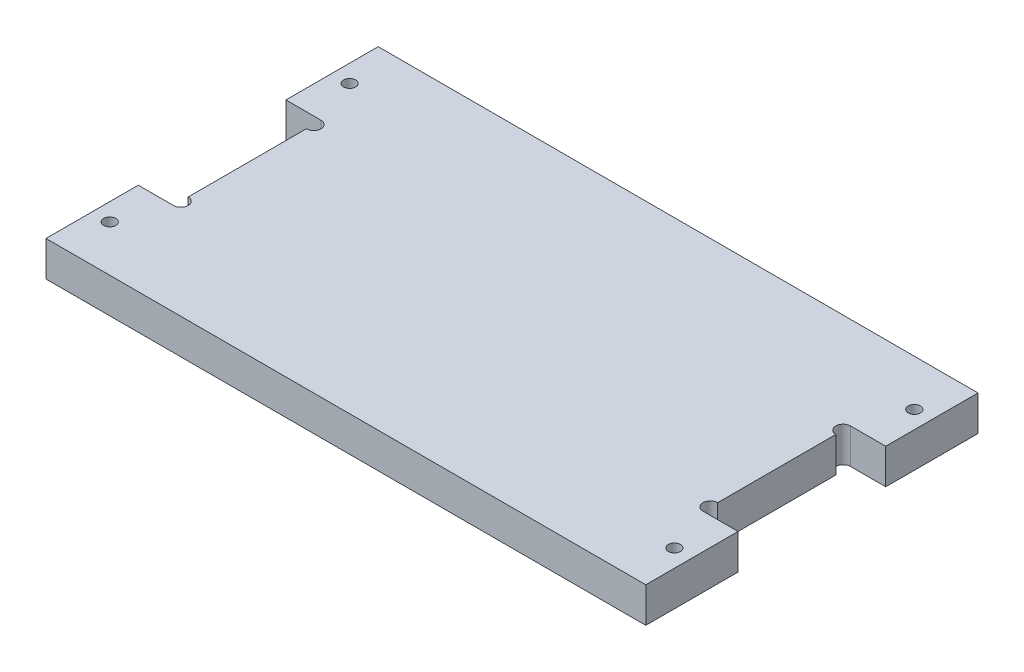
ISO-10303-21;
HEADER;
FILE_DESCRIPTION(('STEP AP214'),'2;1');
FILE_NAME('part.step','',(''),(''),'','','');
FILE_SCHEMA(('AUTOMOTIVE_DESIGN { 1 0 10303 214 1 1 1 1 }'));
ENDSEC;
DATA;
#1=APPLICATION_CONTEXT('core data for automotive mechanical design processes');
#2=APPLICATION_PROTOCOL_DEFINITION('international standard','automotive_design',2000,#1);
#3=PRODUCT_CONTEXT('',#1,'mechanical');
#4=PRODUCT('Part','Part','',(#3));
#5=PRODUCT_RELATED_PRODUCT_CATEGORY('part','',(#4));
#6=PRODUCT_DEFINITION_FORMATION('','',#4);
#7=PRODUCT_DEFINITION_CONTEXT('part definition',#1,'design');
#8=PRODUCT_DEFINITION('design','',#6,#7);
#9=PRODUCT_DEFINITION_SHAPE('','',#8);
#10=(LENGTH_UNIT() NAMED_UNIT(*) SI_UNIT(.MILLI.,.METRE.));
#11=(NAMED_UNIT(*) PLANE_ANGLE_UNIT() SI_UNIT($,.RADIAN.));
#12=(NAMED_UNIT(*) SI_UNIT($,.STERADIAN.) SOLID_ANGLE_UNIT());
#13=UNCERTAINTY_MEASURE_WITH_UNIT(LENGTH_MEASURE(1.E-05),#10,'distance_accuracy_value','');
#14=(GEOMETRIC_REPRESENTATION_CONTEXT(3) GLOBAL_UNCERTAINTY_ASSIGNED_CONTEXT((#13)) GLOBAL_UNIT_ASSIGNED_CONTEXT((#10,
#11,#12)) REPRESENTATION_CONTEXT('',''));
#15=CARTESIAN_POINT('',(0.,0.,0.));
#16=DIRECTION('',(0.,0.,1.));
#17=DIRECTION('',(1.,0.,0.));
#18=AXIS2_PLACEMENT_3D('',#15,#16,#17);
#19=CARTESIAN_POINT('',(0.,19.05,0.));
#20=DIRECTION('',(1.,0.,0.));
#21=DIRECTION('',(0.,0.,-1.));
#22=AXIS2_PLACEMENT_3D('',#19,#20,#21);
#23=PLANE('',#22);
#24=DIRECTION('',(0.,0.,1.));
#25=VECTOR('',#24,1.);
#26=CARTESIAN_POINT('',(0.,19.05,0.));
#27=LINE('',#26,#25);
#28=CARTESIAN_POINT('',(0.,19.05,-50.0000000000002));
#29=VERTEX_POINT('',#28);
#30=CARTESIAN_POINT('',(0.,19.05,0.));
#31=VERTEX_POINT('',#30);
#32=EDGE_CURVE('E249',#29,#31,#27,.T.);
#33=ORIENTED_EDGE('',*,*,#32,.F.);
#34=DIRECTION('',(0.,1.,0.));
#35=VECTOR('',#34,1.);
#36=CARTESIAN_POINT('',(0.,0.,-50.0000000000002));
#37=LINE('',#36,#35);
#38=CARTESIAN_POINT('',(0.,0.,-50.0000000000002));
#39=VERTEX_POINT('',#38);
#40=EDGE_CURVE('E202',#39,#29,#37,.T.);
#41=ORIENTED_EDGE('',*,*,#40,.F.);
#42=DIRECTION('',(0.,0.,1.));
#43=VECTOR('',#42,1.);
#44=CARTESIAN_POINT('',(0.,0.,0.));
#45=LINE('',#44,#43);
#46=CARTESIAN_POINT('',(0.,0.,0.));
#47=VERTEX_POINT('',#46);
#48=EDGE_CURVE('E235',#39,#47,#45,.T.);
#49=ORIENTED_EDGE('',*,*,#48,.T.);
#50=DIRECTION('',(0.,-1.,0.));
#51=VECTOR('',#50,1.);
#52=CARTESIAN_POINT('',(0.,19.05,0.));
#53=LINE('',#52,#51);
#54=EDGE_CURVE('E11',#31,#47,#53,.T.);
#55=ORIENTED_EDGE('',*,*,#54,.F.);
#56=EDGE_LOOP('',(#33,#41,#49,#55));
#57=FACE_BOUND('',#56,.T.);
#58=ADVANCED_FACE('F39',(#57),#23,.F.);
#59=CARTESIAN_POINT('',(325.,19.05,0.));
#60=DIRECTION('',(-1.,0.,0.));
#61=DIRECTION('',(0.,0.,1.));
#62=AXIS2_PLACEMENT_3D('',#59,#60,#61);
#63=PLANE('',#62);
#64=DIRECTION('',(0.,0.,-1.));
#65=VECTOR('',#64,1.);
#66=CARTESIAN_POINT('',(325.,0.,0.));
#67=LINE('',#66,#65);
#68=CARTESIAN_POINT('',(325.,0.,0.));
#69=VERTEX_POINT('',#68);
#70=CARTESIAN_POINT('',(325.,0.,-50.0000000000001));
#71=VERTEX_POINT('',#70);
#72=EDGE_CURVE('E263',#69,#71,#67,.T.);
#73=ORIENTED_EDGE('',*,*,#72,.T.);
#74=DIRECTION('',(0.,1.,0.));
#75=VECTOR('',#74,1.);
#76=CARTESIAN_POINT('',(325.,0.,-50.0000000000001));
#77=LINE('',#76,#75);
#78=CARTESIAN_POINT('',(325.,19.05,-50.0000000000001));
#79=VERTEX_POINT('',#78);
#80=EDGE_CURVE('E232',#71,#79,#77,.T.);
#81=ORIENTED_EDGE('',*,*,#80,.T.);
#82=DIRECTION('',(0.,0.,-1.));
#83=VECTOR('',#82,1.);
#84=CARTESIAN_POINT('',(325.,19.05,0.));
#85=LINE('',#84,#83);
#86=CARTESIAN_POINT('',(325.,19.05,0.));
#87=VERTEX_POINT('',#86);
#88=EDGE_CURVE('E252',#87,#79,#85,.T.);
#89=ORIENTED_EDGE('',*,*,#88,.F.);
#90=DIRECTION('',(0.,-1.,0.));
#91=VECTOR('',#90,1.);
#92=CARTESIAN_POINT('',(325.,19.05,0.));
#93=LINE('',#92,#91);
#94=EDGE_CURVE('E47',#87,#69,#93,.T.);
#95=ORIENTED_EDGE('',*,*,#94,.T.);
#96=EDGE_LOOP('',(#73,#81,#89,#95));
#97=FACE_BOUND('',#96,.T.);
#98=ADVANCED_FACE('F277',(#97),#63,.F.);
#99=CARTESIAN_POINT('',(0.,0.,-180.));
#100=VERTEX_POINT('',#99);
#101=CARTESIAN_POINT('',(0.,0.,-130.));
#102=VERTEX_POINT('',#101);
#103=EDGE_CURVE('E258',#100,#102,#45,.T.);
#104=ORIENTED_EDGE('',*,*,#103,.T.);
#105=DIRECTION('',(0.,1.,0.));
#106=VECTOR('',#105,1.);
#107=CARTESIAN_POINT('',(0.,0.,-130.));
#108=LINE('',#107,#106);
#109=CARTESIAN_POINT('',(0.,19.05,-130.));
#110=VERTEX_POINT('',#109);
#111=EDGE_CURVE('E54',#102,#110,#108,.T.);
#112=ORIENTED_EDGE('',*,*,#111,.T.);
#113=CARTESIAN_POINT('',(0.,19.05,-180.));
#114=VERTEX_POINT('',#113);
#115=EDGE_CURVE('E245',#114,#110,#27,.T.);
#116=ORIENTED_EDGE('',*,*,#115,.F.);
#117=DIRECTION('',(0.,-1.,0.));
#118=VECTOR('',#117,1.);
#119=CARTESIAN_POINT('',(0.,19.05,-180.));
#120=LINE('',#119,#118);
#121=EDGE_CURVE('E257',#114,#100,#120,.T.);
#122=ORIENTED_EDGE('',*,*,#121,.T.);
#123=EDGE_LOOP('',(#104,#112,#116,#122));
#124=FACE_BOUND('',#123,.T.);
#125=ADVANCED_FACE('F41',(#124),#23,.F.);
#126=CARTESIAN_POINT('',(0.,19.05,0.));
#127=DIRECTION('',(0.,0.,-1.));
#128=DIRECTION('',(-1.,0.,0.));
#129=AXIS2_PLACEMENT_3D('',#126,#127,#128);
#130=PLANE('',#129);
#131=DIRECTION('',(1.,0.,0.));
#132=VECTOR('',#131,1.);
#133=CARTESIAN_POINT('',(0.,0.,0.));
#134=LINE('',#133,#132);
#135=EDGE_CURVE('E260',#47,#69,#134,.T.);
#136=ORIENTED_EDGE('',*,*,#135,.T.);
#137=ORIENTED_EDGE('',*,*,#94,.F.);
#138=DIRECTION('',(1.,0.,0.));
#139=VECTOR('',#138,1.);
#140=CARTESIAN_POINT('',(0.,19.05,0.));
#141=LINE('',#140,#139);
#142=EDGE_CURVE('E248',#31,#87,#141,.T.);
#143=ORIENTED_EDGE('',*,*,#142,.F.);
#144=ORIENTED_EDGE('',*,*,#54,.T.);
#145=EDGE_LOOP('',(#136,#137,#143,#144));
#146=FACE_BOUND('',#145,.T.);
#147=ADVANCED_FACE('F294',(#146),#130,.F.);
#148=CARTESIAN_POINT('',(325.,19.05,-130.));
#149=VERTEX_POINT('',#148);
#150=CARTESIAN_POINT('',(325.,19.05,-180.));
#151=VERTEX_POINT('',#150);
#152=EDGE_CURVE('E251',#149,#151,#85,.T.);
#153=ORIENTED_EDGE('',*,*,#152,.F.);
#154=DIRECTION('',(0.,1.,0.));
#155=VECTOR('',#154,1.);
#156=CARTESIAN_POINT('',(325.,0.,-130.));
#157=LINE('',#156,#155);
#158=CARTESIAN_POINT('',(325.,0.,-130.));
#159=VERTEX_POINT('',#158);
#160=EDGE_CURVE('E219',#159,#149,#157,.T.);
#161=ORIENTED_EDGE('',*,*,#160,.F.);
#162=CARTESIAN_POINT('',(325.,0.,-180.));
#163=VERTEX_POINT('',#162);
#164=EDGE_CURVE('E262',#159,#163,#67,.T.);
#165=ORIENTED_EDGE('',*,*,#164,.T.);
#166=DIRECTION('',(0.,-1.,0.));
#167=VECTOR('',#166,1.);
#168=CARTESIAN_POINT('',(325.,19.05,-180.));
#169=LINE('',#168,#167);
#170=EDGE_CURVE('E270',#151,#163,#169,.T.);
#171=ORIENTED_EDGE('',*,*,#170,.F.);
#172=EDGE_LOOP('',(#153,#161,#165,#171));
#173=FACE_BOUND('',#172,.T.);
#174=ADVANCED_FACE('F316',(#173),#63,.F.);
#175=CARTESIAN_POINT('',(0.,19.05,-180.));
#176=DIRECTION('',(0.,0.,1.));
#177=DIRECTION('',(1.,0.,0.));
#178=AXIS2_PLACEMENT_3D('',#175,#176,#177);
#179=PLANE('',#178);
#180=DIRECTION('',(-1.,0.,0.));
#181=VECTOR('',#180,1.);
#182=CARTESIAN_POINT('',(0.,0.,-180.));
#183=LINE('',#182,#181);
#184=EDGE_CURVE('E266',#163,#100,#183,.T.);
#185=ORIENTED_EDGE('',*,*,#184,.T.);
#186=ORIENTED_EDGE('',*,*,#121,.F.);
#187=DIRECTION('',(-1.,0.,0.));
#188=VECTOR('',#187,1.);
#189=CARTESIAN_POINT('',(0.,19.05,-180.));
#190=LINE('',#189,#188);
#191=EDGE_CURVE('E255',#151,#114,#190,.T.);
#192=ORIENTED_EDGE('',*,*,#191,.F.);
#193=ORIENTED_EDGE('',*,*,#170,.T.);
#194=EDGE_LOOP('',(#185,#186,#192,#193));
#195=FACE_BOUND('',#194,.T.);
#196=ADVANCED_FACE('F311',(#195),#179,.F.);
#197=CARTESIAN_POINT('',(0.,19.05,0.));
#198=DIRECTION('',(0.,-1.,0.));
#199=DIRECTION('',(0.,0.,-1.));
#200=AXIS2_PLACEMENT_3D('',#197,#198,#199);
#201=PLANE('',#200);
#202=CARTESIAN_POINT('',(315.475,19.05,-25.));
#203=DIRECTION('',(0.,-1.,0.));
#204=DIRECTION('',(0.,0.,-1.));
#205=AXIS2_PLACEMENT_3D('',#202,#203,#204);
#206=CIRCLE('',#205,3.29999999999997);
#207=CARTESIAN_POINT('',(315.475,19.05,-28.3));
#208=VERTEX_POINT('',#207);
#209=EDGE_CURVE('E520',#208,#208,#206,.T.);
#210=ORIENTED_EDGE('',*,*,#209,.T.);
#211=EDGE_LOOP('',(#210));
#212=FACE_BOUND('',#211,.T.);
#213=CARTESIAN_POINT('',(315.475,19.05,-155.));
#214=DIRECTION('',(0.,-1.,0.));
#215=DIRECTION('',(0.,0.,-1.));
#216=AXIS2_PLACEMENT_3D('',#213,#214,#215);
#217=CIRCLE('',#216,3.29999999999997);
#218=CARTESIAN_POINT('',(315.475,19.05,-158.3));
#219=VERTEX_POINT('',#218);
#220=EDGE_CURVE('E532',#219,#219,#217,.T.);
#221=ORIENTED_EDGE('',*,*,#220,.T.);
#222=EDGE_LOOP('',(#221));
#223=FACE_BOUND('',#222,.T.);
#224=CARTESIAN_POINT('',(9.52499999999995,19.05,-25.));
#225=DIRECTION('',(0.,-1.,0.));
#226=DIRECTION('',(0.,0.,-1.));
#227=AXIS2_PLACEMENT_3D('',#224,#225,#226);
#228=CIRCLE('',#227,3.3);
#229=CARTESIAN_POINT('',(9.52499999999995,19.05,-28.3));
#230=VERTEX_POINT('',#229);
#231=EDGE_CURVE('E544',#230,#230,#228,.T.);
#232=ORIENTED_EDGE('',*,*,#231,.T.);
#233=EDGE_LOOP('',(#232));
#234=FACE_BOUND('',#233,.T.);
#235=CARTESIAN_POINT('',(9.52499999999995,19.05,-155.));
#236=DIRECTION('',(0.,-1.,0.));
#237=DIRECTION('',(0.,0.,-1.));
#238=AXIS2_PLACEMENT_3D('',#235,#236,#237);
#239=CIRCLE('',#238,3.3);
#240=CARTESIAN_POINT('',(9.52499999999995,19.05,-158.3));
#241=VERTEX_POINT('',#240);
#242=EDGE_CURVE('E180',#241,#241,#239,.T.);
#243=ORIENTED_EDGE('',*,*,#242,.T.);
#244=EDGE_LOOP('',(#243));
#245=FACE_BOUND('',#244,.T.);
#246=CARTESIAN_POINT('',(19.05,19.05,-54.0000000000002));
#247=DIRECTION('',(0.,1.,0.));
#248=DIRECTION('',(0.,0.,1.));
#249=AXIS2_PLACEMENT_3D('',#246,#247,#248);
#250=CIRCLE('',#249,3.99999999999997);
#251=CARTESIAN_POINT('',(19.05,19.05,-50.0000000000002));
#252=VERTEX_POINT('',#251);
#253=CARTESIAN_POINT('',(19.05,19.05,-58.0000000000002));
#254=VERTEX_POINT('',#253);
#255=EDGE_CURVE('E177',#252,#254,#250,.T.);
#256=ORIENTED_EDGE('',*,*,#255,.F.);
#257=DIRECTION('',(1.,0.,0.));
#258=VECTOR('',#257,1.);
#259=CARTESIAN_POINT('',(0.,19.05,-50.0000000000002));
#260=LINE('',#259,#258);
#261=EDGE_CURVE('E190',#29,#252,#260,.T.);
#262=ORIENTED_EDGE('',*,*,#261,.F.);
#263=ORIENTED_EDGE('',*,*,#32,.T.);
#264=ORIENTED_EDGE('',*,*,#142,.T.);
#265=ORIENTED_EDGE('',*,*,#88,.T.);
#266=DIRECTION('',(1.,0.,0.));
#267=VECTOR('',#266,1.);
#268=CARTESIAN_POINT('',(325.,19.05,-50.0000000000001));
#269=LINE('',#268,#267);
#270=CARTESIAN_POINT('',(305.95,19.05,-50.0000000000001));
#271=VERTEX_POINT('',#270);
#272=EDGE_CURVE('E208',#271,#79,#269,.T.);
#273=ORIENTED_EDGE('',*,*,#272,.F.);
#274=CARTESIAN_POINT('',(305.95,19.05,-54.0000000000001));
#275=DIRECTION('',(0.,1.,0.));
#276=DIRECTION('',(0.,0.,-1.));
#277=AXIS2_PLACEMENT_3D('',#274,#275,#276);
#278=CIRCLE('',#277,4.);
#279=CARTESIAN_POINT('',(305.95,19.05,-58.0000000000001));
#280=VERTEX_POINT('',#279);
#281=EDGE_CURVE('E228',#280,#271,#278,.T.);
#282=ORIENTED_EDGE('',*,*,#281,.F.);
#283=DIRECTION('',(0.,0.,1.));
#284=VECTOR('',#283,1.);
#285=CARTESIAN_POINT('',(305.95,19.05,-58.0000000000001));
#286=LINE('',#285,#284);
#287=CARTESIAN_POINT('',(305.95,19.05,-122.));
#288=VERTEX_POINT('',#287);
#289=EDGE_CURVE('E225',#288,#280,#286,.T.);
#290=ORIENTED_EDGE('',*,*,#289,.F.);
#291=CARTESIAN_POINT('',(305.95,19.05,-126.));
#292=DIRECTION('',(0.,1.,0.));
#293=DIRECTION('',(0.,0.,1.));
#294=AXIS2_PLACEMENT_3D('',#291,#292,#293);
#295=CIRCLE('',#294,3.99999999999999);
#296=CARTESIAN_POINT('',(305.95,19.05,-130.));
#297=VERTEX_POINT('',#296);
#298=EDGE_CURVE('E222',#297,#288,#295,.T.);
#299=ORIENTED_EDGE('',*,*,#298,.F.);
#300=DIRECTION('',(-1.,0.,0.));
#301=VECTOR('',#300,1.);
#302=CARTESIAN_POINT('',(325.,19.05,-130.));
#303=LINE('',#302,#301);
#304=EDGE_CURVE('E197',#149,#297,#303,.T.);
#305=ORIENTED_EDGE('',*,*,#304,.F.);
#306=ORIENTED_EDGE('',*,*,#152,.T.);
#307=ORIENTED_EDGE('',*,*,#191,.T.);
#308=ORIENTED_EDGE('',*,*,#115,.T.);
#309=DIRECTION('',(-1.,0.,0.));
#310=VECTOR('',#309,1.);
#311=CARTESIAN_POINT('',(0.,19.05,-130.));
#312=LINE('',#311,#310);
#313=CARTESIAN_POINT('',(19.05,19.05,-130.));
#314=VERTEX_POINT('',#313);
#315=EDGE_CURVE('E188',#314,#110,#312,.T.);
#316=ORIENTED_EDGE('',*,*,#315,.F.);
#317=CARTESIAN_POINT('',(19.05,19.05,-126.));
#318=DIRECTION('',(0.,1.,0.));
#319=DIRECTION('',(0.,0.,-1.));
#320=AXIS2_PLACEMENT_3D('',#317,#318,#319);
#321=CIRCLE('',#320,3.99999999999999);
#322=CARTESIAN_POINT('',(19.05,19.05,-122.));
#323=VERTEX_POINT('',#322);
#324=EDGE_CURVE('E159',#323,#314,#321,.T.);
#325=ORIENTED_EDGE('',*,*,#324,.F.);
#326=DIRECTION('',(0.,0.,-1.));
#327=VECTOR('',#326,1.);
#328=CARTESIAN_POINT('',(19.05,19.05,-58.0000000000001));
#329=LINE('',#328,#327);
#330=EDGE_CURVE('E174',#254,#323,#329,.T.);
#331=ORIENTED_EDGE('',*,*,#330,.F.);
#332=EDGE_LOOP('',(#256,#262,#263,#264,#265,#273,#282,#290,#299,#305,#306,#307,#308,#316,#325,#331));
#333=FACE_BOUND('',#332,.T.);
#334=ADVANCED_FACE('F289',(#212,#223,#234,#245,#333),#201,.F.);
#335=CARTESIAN_POINT('',(0.,0.,0.));
#336=DIRECTION('',(0.,-1.,0.));
#337=DIRECTION('',(0.,0.,-1.));
#338=AXIS2_PLACEMENT_3D('',#335,#336,#337);
#339=PLANE('',#338);
#340=CARTESIAN_POINT('',(315.475,0.,-25.));
#341=DIRECTION('',(0.,-1.,0.));
#342=DIRECTION('',(0.,0.,-1.));
#343=AXIS2_PLACEMENT_3D('',#340,#341,#342);
#344=CIRCLE('',#343,5.50000000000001);
#345=CARTESIAN_POINT('',(315.475,0.,-30.5));
#346=VERTEX_POINT('',#345);
#347=EDGE_CURVE('E513',#346,#346,#344,.T.);
#348=ORIENTED_EDGE('',*,*,#347,.F.);
#349=EDGE_LOOP('',(#348));
#350=FACE_BOUND('',#349,.T.);
#351=CARTESIAN_POINT('',(315.475,0.,-155.));
#352=DIRECTION('',(0.,-1.,0.));
#353=DIRECTION('',(0.,0.,-1.));
#354=AXIS2_PLACEMENT_3D('',#351,#352,#353);
#355=CIRCLE('',#354,5.50000000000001);
#356=CARTESIAN_POINT('',(315.475,0.,-160.5));
#357=VERTEX_POINT('',#356);
#358=EDGE_CURVE('E523',#357,#357,#355,.T.);
#359=ORIENTED_EDGE('',*,*,#358,.F.);
#360=EDGE_LOOP('',(#359));
#361=FACE_BOUND('',#360,.T.);
#362=CARTESIAN_POINT('',(9.52499999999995,0.,-25.));
#363=DIRECTION('',(0.,-1.,0.));
#364=DIRECTION('',(0.,0.,-1.));
#365=AXIS2_PLACEMENT_3D('',#362,#363,#364);
#366=CIRCLE('',#365,5.49999999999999);
#367=CARTESIAN_POINT('',(9.52499999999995,0.,-30.5));
#368=VERTEX_POINT('',#367);
#369=EDGE_CURVE('E535',#368,#368,#366,.T.);
#370=ORIENTED_EDGE('',*,*,#369,.F.);
#371=EDGE_LOOP('',(#370));
#372=FACE_BOUND('',#371,.T.);
#373=CARTESIAN_POINT('',(9.52499999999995,0.,-155.));
#374=DIRECTION('',(0.,-1.,0.));
#375=DIRECTION('',(0.,0.,-1.));
#376=AXIS2_PLACEMENT_3D('',#373,#374,#375);
#377=CIRCLE('',#376,5.49999999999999);
#378=CARTESIAN_POINT('',(9.52499999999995,0.,-160.5));
#379=VERTEX_POINT('',#378);
#380=EDGE_CURVE('E547',#379,#379,#377,.T.);
#381=ORIENTED_EDGE('',*,*,#380,.F.);
#382=EDGE_LOOP('',(#381));
#383=FACE_BOUND('',#382,.T.);
#384=DIRECTION('',(1.,0.,0.));
#385=VECTOR('',#384,1.);
#386=CARTESIAN_POINT('',(0.,0.,-50.0000000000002));
#387=LINE('',#386,#385);
#388=CARTESIAN_POINT('',(19.05,0.,-50.0000000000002));
#389=VERTEX_POINT('',#388);
#390=EDGE_CURVE('E168',#39,#389,#387,.T.);
#391=ORIENTED_EDGE('',*,*,#390,.T.);
#392=CARTESIAN_POINT('',(19.05,0.,-54.0000000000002));
#393=DIRECTION('',(0.,1.,0.));
#394=DIRECTION('',(0.,0.,1.));
#395=AXIS2_PLACEMENT_3D('',#392,#393,#394);
#396=CIRCLE('',#395,3.99999999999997);
#397=CARTESIAN_POINT('',(19.05,0.,-58.0000000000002));
#398=VERTEX_POINT('',#397);
#399=EDGE_CURVE('E184',#389,#398,#396,.T.);
#400=ORIENTED_EDGE('',*,*,#399,.T.);
#401=DIRECTION('',(0.,0.,-1.));
#402=VECTOR('',#401,1.);
#403=CARTESIAN_POINT('',(19.05,0.,-58.0000000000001));
#404=LINE('',#403,#402);
#405=CARTESIAN_POINT('',(19.05,0.,-122.));
#406=VERTEX_POINT('',#405);
#407=EDGE_CURVE('E161',#398,#406,#404,.T.);
#408=ORIENTED_EDGE('',*,*,#407,.T.);
#409=CARTESIAN_POINT('',(19.05,0.,-126.));
#410=DIRECTION('',(0.,1.,0.));
#411=DIRECTION('',(0.,0.,-1.));
#412=AXIS2_PLACEMENT_3D('',#409,#410,#411);
#413=CIRCLE('',#412,3.99999999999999);
#414=CARTESIAN_POINT('',(19.05,0.,-130.));
#415=VERTEX_POINT('',#414);
#416=EDGE_CURVE('E156',#406,#415,#413,.T.);
#417=ORIENTED_EDGE('',*,*,#416,.T.);
#418=DIRECTION('',(-1.,0.,0.));
#419=VECTOR('',#418,1.);
#420=CARTESIAN_POINT('',(0.,0.,-130.));
#421=LINE('',#420,#419);
#422=EDGE_CURVE('E163',#415,#102,#421,.T.);
#423=ORIENTED_EDGE('',*,*,#422,.T.);
#424=ORIENTED_EDGE('',*,*,#103,.F.);
#425=ORIENTED_EDGE('',*,*,#184,.F.);
#426=ORIENTED_EDGE('',*,*,#164,.F.);
#427=DIRECTION('',(-1.,0.,0.));
#428=VECTOR('',#427,1.);
#429=CARTESIAN_POINT('',(325.,0.,-130.));
#430=LINE('',#429,#428);
#431=CARTESIAN_POINT('',(305.95,0.,-130.));
#432=VERTEX_POINT('',#431);
#433=EDGE_CURVE('E205',#159,#432,#430,.T.);
#434=ORIENTED_EDGE('',*,*,#433,.T.);
#435=CARTESIAN_POINT('',(305.95,0.,-126.));
#436=DIRECTION('',(0.,1.,0.));
#437=DIRECTION('',(0.,0.,1.));
#438=AXIS2_PLACEMENT_3D('',#435,#436,#437);
#439=CIRCLE('',#438,3.99999999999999);
#440=CARTESIAN_POINT('',(305.95,0.,-122.));
#441=VERTEX_POINT('',#440);
#442=EDGE_CURVE('E62',#432,#441,#439,.T.);
#443=ORIENTED_EDGE('',*,*,#442,.T.);
#444=DIRECTION('',(0.,0.,1.));
#445=VECTOR('',#444,1.);
#446=CARTESIAN_POINT('',(305.95,0.,-58.0000000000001));
#447=LINE('',#446,#445);
#448=CARTESIAN_POINT('',(305.95,0.,-58.0000000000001));
#449=VERTEX_POINT('',#448);
#450=EDGE_CURVE('E210',#441,#449,#447,.T.);
#451=ORIENTED_EDGE('',*,*,#450,.T.);
#452=CARTESIAN_POINT('',(305.95,0.,-54.0000000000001));
#453=DIRECTION('',(0.,1.,0.));
#454=DIRECTION('',(0.,0.,-1.));
#455=AXIS2_PLACEMENT_3D('',#452,#453,#454);
#456=CIRCLE('',#455,4.);
#457=CARTESIAN_POINT('',(305.95,0.,-50.0000000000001));
#458=VERTEX_POINT('',#457);
#459=EDGE_CURVE('E213',#449,#458,#456,.T.);
#460=ORIENTED_EDGE('',*,*,#459,.T.);
#461=DIRECTION('',(1.,0.,0.));
#462=VECTOR('',#461,1.);
#463=CARTESIAN_POINT('',(325.,0.,-50.0000000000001));
#464=LINE('',#463,#462);
#465=EDGE_CURVE('E216',#458,#71,#464,.T.);
#466=ORIENTED_EDGE('',*,*,#465,.T.);
#467=ORIENTED_EDGE('',*,*,#72,.F.);
#468=ORIENTED_EDGE('',*,*,#135,.F.);
#469=ORIENTED_EDGE('',*,*,#48,.F.);
#470=EDGE_LOOP('',(#391,#400,#408,#417,#423,#424,#425,#426,#434,#443,#451,#460,#466,#467,#468,#469));
#471=FACE_BOUND('',#470,.T.);
#472=ADVANCED_FACE('F171',(#350,#361,#372,#383,#471),#339,.T.);
#473=CARTESIAN_POINT('',(325.,0.,-50.0000000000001));
#474=DIRECTION('',(0.,0.,1.));
#475=DIRECTION('',(1.,0.,0.));
#476=AXIS2_PLACEMENT_3D('',#473,#474,#475);
#477=PLANE('',#476);
#478=ORIENTED_EDGE('',*,*,#272,.T.);
#479=ORIENTED_EDGE('',*,*,#80,.F.);
#480=ORIENTED_EDGE('',*,*,#465,.F.);
#481=DIRECTION('',(0.,1.,0.));
#482=VECTOR('',#481,1.);
#483=CARTESIAN_POINT('',(305.95,0.,-50.0000000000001));
#484=LINE('',#483,#482);
#485=EDGE_CURVE('E236',#458,#271,#484,.T.);
#486=ORIENTED_EDGE('',*,*,#485,.T.);
#487=EDGE_LOOP('',(#478,#479,#480,#486));
#488=FACE_BOUND('',#487,.T.);
#489=ADVANCED_FACE('F285',(#488),#477,.F.);
#490=CARTESIAN_POINT('',(305.95,0.,-54.0000000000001));
#491=DIRECTION('',(0.,1.,0.));
#492=DIRECTION('',(0.,0.,1.));
#493=AXIS2_PLACEMENT_3D('',#490,#491,#492);
#494=CYLINDRICAL_SURFACE('',#493,4.);
#495=ORIENTED_EDGE('',*,*,#281,.T.);
#496=ORIENTED_EDGE('',*,*,#485,.F.);
#497=ORIENTED_EDGE('',*,*,#459,.F.);
#498=DIRECTION('',(0.,1.,0.));
#499=VECTOR('',#498,1.);
#500=CARTESIAN_POINT('',(305.95,0.,-58.0000000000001));
#501=LINE('',#500,#499);
#502=EDGE_CURVE('E238',#449,#280,#501,.T.);
#503=ORIENTED_EDGE('',*,*,#502,.T.);
#504=EDGE_LOOP('',(#495,#496,#497,#503));
#505=FACE_BOUND('',#504,.T.);
#506=ADVANCED_FACE('F328',(#505),#494,.F.);
#507=CARTESIAN_POINT('',(305.95,0.,-58.0000000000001));
#508=DIRECTION('',(-1.,0.,0.));
#509=DIRECTION('',(0.,0.,1.));
#510=AXIS2_PLACEMENT_3D('',#507,#508,#509);
#511=PLANE('',#510);
#512=ORIENTED_EDGE('',*,*,#289,.T.);
#513=ORIENTED_EDGE('',*,*,#502,.F.);
#514=ORIENTED_EDGE('',*,*,#450,.F.);
#515=DIRECTION('',(0.,1.,0.));
#516=VECTOR('',#515,1.);
#517=CARTESIAN_POINT('',(305.95,0.,-122.));
#518=LINE('',#517,#516);
#519=EDGE_CURVE('E240',#441,#288,#518,.T.);
#520=ORIENTED_EDGE('',*,*,#519,.T.);
#521=EDGE_LOOP('',(#512,#513,#514,#520));
#522=FACE_BOUND('',#521,.T.);
#523=ADVANCED_FACE('F326',(#522),#511,.F.);
#524=CARTESIAN_POINT('',(305.95,0.,-126.));
#525=DIRECTION('',(0.,1.,0.));
#526=DIRECTION('',(0.,0.,1.));
#527=AXIS2_PLACEMENT_3D('',#524,#525,#526);
#528=CYLINDRICAL_SURFACE('',#527,3.99999999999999);
#529=ORIENTED_EDGE('',*,*,#298,.T.);
#530=ORIENTED_EDGE('',*,*,#519,.F.);
#531=ORIENTED_EDGE('',*,*,#442,.F.);
#532=DIRECTION('',(0.,1.,0.));
#533=VECTOR('',#532,1.);
#534=CARTESIAN_POINT('',(305.95,0.,-130.));
#535=LINE('',#534,#533);
#536=EDGE_CURVE('E242',#432,#297,#535,.T.);
#537=ORIENTED_EDGE('',*,*,#536,.T.);
#538=EDGE_LOOP('',(#529,#530,#531,#537));
#539=FACE_BOUND('',#538,.T.);
#540=ADVANCED_FACE('F323',(#539),#528,.F.);
#541=CARTESIAN_POINT('',(325.,0.,-130.));
#542=DIRECTION('',(0.,0.,-1.));
#543=DIRECTION('',(-1.,0.,0.));
#544=AXIS2_PLACEMENT_3D('',#541,#542,#543);
#545=PLANE('',#544);
#546=ORIENTED_EDGE('',*,*,#304,.T.);
#547=ORIENTED_EDGE('',*,*,#536,.F.);
#548=ORIENTED_EDGE('',*,*,#433,.F.);
#549=ORIENTED_EDGE('',*,*,#160,.T.);
#550=EDGE_LOOP('',(#546,#547,#548,#549));
#551=FACE_BOUND('',#550,.T.);
#552=ADVANCED_FACE('F320',(#551),#545,.F.);
#553=CARTESIAN_POINT('',(19.05,0.,-126.));
#554=DIRECTION('',(0.,1.,0.));
#555=DIRECTION('',(0.,0.,1.));
#556=AXIS2_PLACEMENT_3D('',#553,#554,#555);
#557=CYLINDRICAL_SURFACE('',#556,3.99999999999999);
#558=ORIENTED_EDGE('',*,*,#324,.T.);
#559=DIRECTION('',(0.,1.,0.));
#560=VECTOR('',#559,1.);
#561=CARTESIAN_POINT('',(19.05,0.,-130.));
#562=LINE('',#561,#560);
#563=EDGE_CURVE('E153',#415,#314,#562,.T.);
#564=ORIENTED_EDGE('',*,*,#563,.F.);
#565=ORIENTED_EDGE('',*,*,#416,.F.);
#566=DIRECTION('',(0.,1.,0.));
#567=VECTOR('',#566,1.);
#568=CARTESIAN_POINT('',(19.05,0.,-122.));
#569=LINE('',#568,#567);
#570=EDGE_CURVE('E195',#406,#323,#569,.T.);
#571=ORIENTED_EDGE('',*,*,#570,.T.);
#572=EDGE_LOOP('',(#558,#564,#565,#571));
#573=FACE_BOUND('',#572,.T.);
#574=ADVANCED_FACE('F154',(#573),#557,.F.);
#575=CARTESIAN_POINT('',(19.05,0.,-58.0000000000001));
#576=DIRECTION('',(1.,0.,0.));
#577=DIRECTION('',(0.,0.,-1.));
#578=AXIS2_PLACEMENT_3D('',#575,#576,#577);
#579=PLANE('',#578);
#580=ORIENTED_EDGE('',*,*,#330,.T.);
#581=ORIENTED_EDGE('',*,*,#570,.F.);
#582=ORIENTED_EDGE('',*,*,#407,.F.);
#583=DIRECTION('',(0.,1.,0.));
#584=VECTOR('',#583,1.);
#585=CARTESIAN_POINT('',(19.05,0.,-58.0000000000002));
#586=LINE('',#585,#584);
#587=EDGE_CURVE('E198',#398,#254,#586,.T.);
#588=ORIENTED_EDGE('',*,*,#587,.T.);
#589=EDGE_LOOP('',(#580,#581,#582,#588));
#590=FACE_BOUND('',#589,.T.);
#591=ADVANCED_FACE('F304',(#590),#579,.F.);
#592=CARTESIAN_POINT('',(19.05,0.,-54.0000000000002));
#593=DIRECTION('',(0.,1.,0.));
#594=DIRECTION('',(0.,0.,1.));
#595=AXIS2_PLACEMENT_3D('',#592,#593,#594);
#596=CYLINDRICAL_SURFACE('',#595,3.99999999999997);
#597=ORIENTED_EDGE('',*,*,#255,.T.);
#598=ORIENTED_EDGE('',*,*,#587,.F.);
#599=ORIENTED_EDGE('',*,*,#399,.F.);
#600=DIRECTION('',(0.,1.,0.));
#601=VECTOR('',#600,1.);
#602=CARTESIAN_POINT('',(19.05,0.,-50.0000000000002));
#603=LINE('',#602,#601);
#604=EDGE_CURVE('E200',#389,#252,#603,.T.);
#605=ORIENTED_EDGE('',*,*,#604,.T.);
#606=EDGE_LOOP('',(#597,#598,#599,#605));
#607=FACE_BOUND('',#606,.T.);
#608=ADVANCED_FACE('F301',(#607),#596,.F.);
#609=CARTESIAN_POINT('',(0.,0.,-50.0000000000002));
#610=DIRECTION('',(0.,0.,1.));
#611=DIRECTION('',(1.,0.,0.));
#612=AXIS2_PLACEMENT_3D('',#609,#610,#611);
#613=PLANE('',#612);
#614=ORIENTED_EDGE('',*,*,#261,.T.);
#615=ORIENTED_EDGE('',*,*,#604,.F.);
#616=ORIENTED_EDGE('',*,*,#390,.F.);
#617=ORIENTED_EDGE('',*,*,#40,.T.);
#618=EDGE_LOOP('',(#614,#615,#616,#617));
#619=FACE_BOUND('',#618,.T.);
#620=ADVANCED_FACE('F299',(#619),#613,.F.);
#621=CARTESIAN_POINT('',(0.,0.,-130.));
#622=DIRECTION('',(0.,0.,-1.));
#623=DIRECTION('',(-1.,0.,0.));
#624=AXIS2_PLACEMENT_3D('',#621,#622,#623);
#625=PLANE('',#624);
#626=ORIENTED_EDGE('',*,*,#315,.T.);
#627=ORIENTED_EDGE('',*,*,#111,.F.);
#628=ORIENTED_EDGE('',*,*,#422,.F.);
#629=ORIENTED_EDGE('',*,*,#563,.T.);
#630=EDGE_LOOP('',(#626,#627,#628,#629));
#631=FACE_BOUND('',#630,.T.);
#632=ADVANCED_FACE('F164',(#631),#625,.F.);
#633=CARTESIAN_POINT('',(9.52499999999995,0.,-155.));
#634=DIRECTION('',(0.,-1.,0.));
#635=DIRECTION('',(0.,0.,-1.));
#636=AXIS2_PLACEMENT_3D('',#633,#634,#635);
#637=CYLINDRICAL_SURFACE('',#636,3.3);
#638=ORIENTED_EDGE('',*,*,#242,.F.);
#639=EDGE_LOOP('',(#638));
#640=FACE_BOUND('',#639,.T.);
#641=CARTESIAN_POINT('',(9.52499999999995,6.,-155.));
#642=DIRECTION('',(0.,-1.,0.));
#643=DIRECTION('',(0.,0.,-1.));
#644=AXIS2_PLACEMENT_3D('',#641,#642,#643);
#645=CIRCLE('',#644,3.3);
#646=CARTESIAN_POINT('',(9.52499999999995,6.,-158.3));
#647=VERTEX_POINT('',#646);
#648=EDGE_CURVE('E552',#647,#647,#645,.T.);
#649=ORIENTED_EDGE('',*,*,#648,.T.);
#650=EDGE_LOOP('',(#649));
#651=FACE_BOUND('',#650,.T.);
#652=ADVANCED_FACE('F398',(#640,#651),#637,.F.);
#653=CARTESIAN_POINT('',(12.8249999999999,6.,-155.));
#654=DIRECTION('',(0.,1.,0.));
#655=DIRECTION('',(0.,0.,1.));
#656=AXIS2_PLACEMENT_3D('',#653,#654,#655);
#657=PLANE('',#656);
#658=ORIENTED_EDGE('',*,*,#648,.F.);
#659=EDGE_LOOP('',(#658));
#660=FACE_BOUND('',#659,.T.);
#661=CARTESIAN_POINT('',(9.52499999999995,6.,-155.));
#662=DIRECTION('',(0.,-1.,0.));
#663=DIRECTION('',(0.,0.,-1.));
#664=AXIS2_PLACEMENT_3D('',#661,#662,#663);
#665=CIRCLE('',#664,5.5);
#666=CARTESIAN_POINT('',(9.52499999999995,6.,-160.5));
#667=VERTEX_POINT('',#666);
#668=EDGE_CURVE('E550',#667,#667,#665,.T.);
#669=ORIENTED_EDGE('',*,*,#668,.T.);
#670=EDGE_LOOP('',(#669));
#671=FACE_BOUND('',#670,.T.);
#672=ADVANCED_FACE('F416',(#660,#671),#657,.F.);
#673=CARTESIAN_POINT('',(9.52499999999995,0.,-155.));
#674=DIRECTION('',(0.,-1.,0.));
#675=DIRECTION('',(0.,0.,-1.));
#676=AXIS2_PLACEMENT_3D('',#673,#674,#675);
#677=CYLINDRICAL_SURFACE('',#676,5.5);
#678=ORIENTED_EDGE('',*,*,#668,.F.);
#679=EDGE_LOOP('',(#678));
#680=FACE_BOUND('',#679,.T.);
#681=ORIENTED_EDGE('',*,*,#380,.T.);
#682=EDGE_LOOP('',(#681));
#683=FACE_BOUND('',#682,.T.);
#684=ADVANCED_FACE('F424',(#680,#683),#677,.F.);
#685=CARTESIAN_POINT('',(9.52499999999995,0.,-25.));
#686=DIRECTION('',(0.,-1.,0.));
#687=DIRECTION('',(0.,0.,-1.));
#688=AXIS2_PLACEMENT_3D('',#685,#686,#687);
#689=CYLINDRICAL_SURFACE('',#688,3.3);
#690=ORIENTED_EDGE('',*,*,#231,.F.);
#691=EDGE_LOOP('',(#690));
#692=FACE_BOUND('',#691,.T.);
#693=CARTESIAN_POINT('',(9.52499999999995,6.,-25.));
#694=DIRECTION('',(0.,-1.,0.));
#695=DIRECTION('',(0.,0.,-1.));
#696=AXIS2_PLACEMENT_3D('',#693,#694,#695);
#697=CIRCLE('',#696,3.3);
#698=CARTESIAN_POINT('',(9.52499999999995,6.,-28.3));
#699=VERTEX_POINT('',#698);
#700=EDGE_CURVE('E541',#699,#699,#697,.T.);
#701=ORIENTED_EDGE('',*,*,#700,.T.);
#702=EDGE_LOOP('',(#701));
#703=FACE_BOUND('',#702,.T.);
#704=ADVANCED_FACE('F432',(#692,#703),#689,.F.);
#705=CARTESIAN_POINT('',(12.8249999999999,6.,-25.));
#706=DIRECTION('',(0.,1.,0.));
#707=DIRECTION('',(0.,0.,1.));
#708=AXIS2_PLACEMENT_3D('',#705,#706,#707);
#709=PLANE('',#708);
#710=ORIENTED_EDGE('',*,*,#700,.F.);
#711=EDGE_LOOP('',(#710));
#712=FACE_BOUND('',#711,.T.);
#713=CARTESIAN_POINT('',(9.52499999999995,6.,-25.));
#714=DIRECTION('',(0.,-1.,0.));
#715=DIRECTION('',(0.,0.,-1.));
#716=AXIS2_PLACEMENT_3D('',#713,#714,#715);
#717=CIRCLE('',#716,5.5);
#718=CARTESIAN_POINT('',(9.52499999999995,6.,-30.5));
#719=VERTEX_POINT('',#718);
#720=EDGE_CURVE('E538',#719,#719,#717,.T.);
#721=ORIENTED_EDGE('',*,*,#720,.T.);
#722=EDGE_LOOP('',(#721));
#723=FACE_BOUND('',#722,.T.);
#724=ADVANCED_FACE('F440',(#712,#723),#709,.F.);
#725=CARTESIAN_POINT('',(9.52499999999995,0.,-25.));
#726=DIRECTION('',(0.,-1.,0.));
#727=DIRECTION('',(0.,0.,-1.));
#728=AXIS2_PLACEMENT_3D('',#725,#726,#727);
#729=CYLINDRICAL_SURFACE('',#728,5.5);
#730=ORIENTED_EDGE('',*,*,#720,.F.);
#731=EDGE_LOOP('',(#730));
#732=FACE_BOUND('',#731,.T.);
#733=ORIENTED_EDGE('',*,*,#369,.T.);
#734=EDGE_LOOP('',(#733));
#735=FACE_BOUND('',#734,.T.);
#736=ADVANCED_FACE('F448',(#732,#735),#729,.F.);
#737=CARTESIAN_POINT('',(315.475,0.,-155.));
#738=DIRECTION('',(0.,-1.,0.));
#739=DIRECTION('',(0.,0.,-1.));
#740=AXIS2_PLACEMENT_3D('',#737,#738,#739);
#741=CYLINDRICAL_SURFACE('',#740,3.3);
#742=ORIENTED_EDGE('',*,*,#220,.F.);
#743=EDGE_LOOP('',(#742));
#744=FACE_BOUND('',#743,.T.);
#745=CARTESIAN_POINT('',(315.475,6.,-155.));
#746=DIRECTION('',(0.,-1.,0.));
#747=DIRECTION('',(0.,0.,-1.));
#748=AXIS2_PLACEMENT_3D('',#745,#746,#747);
#749=CIRCLE('',#748,3.30000000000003);
#750=CARTESIAN_POINT('',(315.475,6.,-158.3));
#751=VERTEX_POINT('',#750);
#752=EDGE_CURVE('E529',#751,#751,#749,.T.);
#753=ORIENTED_EDGE('',*,*,#752,.T.);
#754=EDGE_LOOP('',(#753));
#755=FACE_BOUND('',#754,.T.);
#756=ADVANCED_FACE('F456',(#744,#755),#741,.F.);
#757=CARTESIAN_POINT('',(318.775,6.,-155.));
#758=DIRECTION('',(0.,1.,0.));
#759=DIRECTION('',(0.,0.,1.));
#760=AXIS2_PLACEMENT_3D('',#757,#758,#759);
#761=PLANE('',#760);
#762=ORIENTED_EDGE('',*,*,#752,.F.);
#763=EDGE_LOOP('',(#762));
#764=FACE_BOUND('',#763,.T.);
#765=CARTESIAN_POINT('',(315.475,6.,-155.));
#766=DIRECTION('',(0.,-1.,0.));
#767=DIRECTION('',(0.,0.,-1.));
#768=AXIS2_PLACEMENT_3D('',#765,#766,#767);
#769=CIRCLE('',#768,5.50000000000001);
#770=CARTESIAN_POINT('',(315.475,6.,-160.5));
#771=VERTEX_POINT('',#770);
#772=EDGE_CURVE('E526',#771,#771,#769,.T.);
#773=ORIENTED_EDGE('',*,*,#772,.T.);
#774=EDGE_LOOP('',(#773));
#775=FACE_BOUND('',#774,.T.);
#776=ADVANCED_FACE('F464',(#764,#775),#761,.F.);
#777=CARTESIAN_POINT('',(315.475,0.,-155.));
#778=DIRECTION('',(0.,-1.,0.));
#779=DIRECTION('',(0.,0.,-1.));
#780=AXIS2_PLACEMENT_3D('',#777,#778,#779);
#781=CYLINDRICAL_SURFACE('',#780,5.50000000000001);
#782=ORIENTED_EDGE('',*,*,#772,.F.);
#783=EDGE_LOOP('',(#782));
#784=FACE_BOUND('',#783,.T.);
#785=ORIENTED_EDGE('',*,*,#358,.T.);
#786=EDGE_LOOP('',(#785));
#787=FACE_BOUND('',#786,.T.);
#788=ADVANCED_FACE('F472',(#784,#787),#781,.F.);
#789=CARTESIAN_POINT('',(315.475,0.,-25.));
#790=DIRECTION('',(0.,-1.,0.));
#791=DIRECTION('',(0.,0.,-1.));
#792=AXIS2_PLACEMENT_3D('',#789,#790,#791);
#793=CYLINDRICAL_SURFACE('',#792,3.3);
#794=ORIENTED_EDGE('',*,*,#209,.F.);
#795=EDGE_LOOP('',(#794));
#796=FACE_BOUND('',#795,.T.);
#797=CARTESIAN_POINT('',(315.475,6.,-25.));
#798=DIRECTION('',(0.,-1.,0.));
#799=DIRECTION('',(0.,0.,-1.));
#800=AXIS2_PLACEMENT_3D('',#797,#798,#799);
#801=CIRCLE('',#800,3.30000000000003);
#802=CARTESIAN_POINT('',(315.475,6.,-28.3));
#803=VERTEX_POINT('',#802);
#804=EDGE_CURVE('E515',#803,#803,#801,.T.);
#805=ORIENTED_EDGE('',*,*,#804,.T.);
#806=EDGE_LOOP('',(#805));
#807=FACE_BOUND('',#806,.T.);
#808=ADVANCED_FACE('F480',(#796,#807),#793,.F.);
#809=CARTESIAN_POINT('',(318.775,6.,-25.));
#810=DIRECTION('',(0.,1.,0.));
#811=DIRECTION('',(0.,0.,1.));
#812=AXIS2_PLACEMENT_3D('',#809,#810,#811);
#813=PLANE('',#812);
#814=ORIENTED_EDGE('',*,*,#804,.F.);
#815=EDGE_LOOP('',(#814));
#816=FACE_BOUND('',#815,.T.);
#817=CARTESIAN_POINT('',(315.475,6.,-25.));
#818=DIRECTION('',(0.,-1.,0.));
#819=DIRECTION('',(0.,0.,-1.));
#820=AXIS2_PLACEMENT_3D('',#817,#818,#819);
#821=CIRCLE('',#820,5.50000000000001);
#822=CARTESIAN_POINT('',(315.475,6.,-30.5));
#823=VERTEX_POINT('',#822);
#824=EDGE_CURVE('E510',#823,#823,#821,.T.);
#825=ORIENTED_EDGE('',*,*,#824,.T.);
#826=EDGE_LOOP('',(#825));
#827=FACE_BOUND('',#826,.T.);
#828=ADVANCED_FACE('F488',(#816,#827),#813,.F.);
#829=CARTESIAN_POINT('',(315.475,0.,-25.));
#830=DIRECTION('',(0.,-1.,0.));
#831=DIRECTION('',(0.,0.,-1.));
#832=AXIS2_PLACEMENT_3D('',#829,#830,#831);
#833=CYLINDRICAL_SURFACE('',#832,5.50000000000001);
#834=ORIENTED_EDGE('',*,*,#824,.F.);
#835=EDGE_LOOP('',(#834));
#836=FACE_BOUND('',#835,.T.);
#837=ORIENTED_EDGE('',*,*,#347,.T.);
#838=EDGE_LOOP('',(#837));
#839=FACE_BOUND('',#838,.T.);
#840=ADVANCED_FACE('F496',(#836,#839),#833,.F.);
#841=CLOSED_SHELL('',(#58,#98,#125,#147,#174,#196,#334,#472,#489,#506,#523,#540,#552,#574,#591,
#608,#620,#632,#652,#672,#684,#704,#724,#736,#756,#776,#788,#808,#828,#840));
#842=MANIFOLD_SOLID_BREP('B2',#841);
#843=ADVANCED_BREP_SHAPE_REPRESENTATION('',(#18,#842),#14);
#844=SHAPE_DEFINITION_REPRESENTATION(#9,#843);
ENDSEC;
END-ISO-10303-21;
